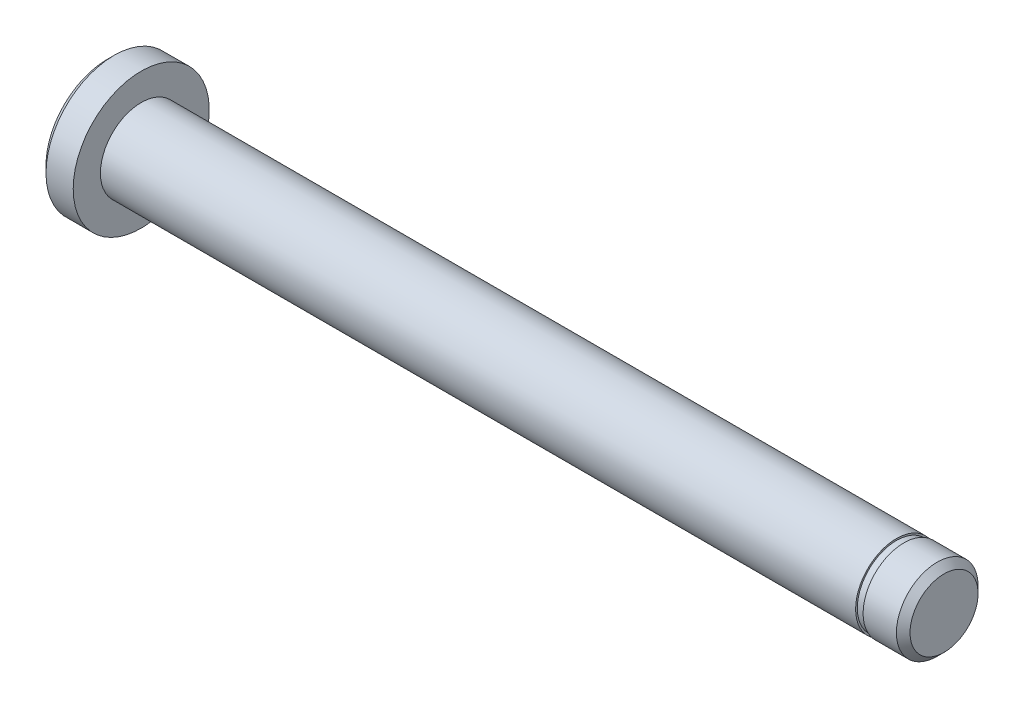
ISO-10303-21;
HEADER;
FILE_DESCRIPTION(('STEP AP214'),'2;1');
FILE_NAME('part.step','',(''),(''),'','','');
FILE_SCHEMA(('AUTOMOTIVE_DESIGN { 1 0 10303 214 1 1 1 1 }'));
ENDSEC;
DATA;
#1=APPLICATION_CONTEXT('core data for automotive mechanical design processes');
#2=APPLICATION_PROTOCOL_DEFINITION('international standard','automotive_design',2000,#1);
#3=PRODUCT_CONTEXT('',#1,'mechanical');
#4=PRODUCT('Part','Part','',(#3));
#5=PRODUCT_RELATED_PRODUCT_CATEGORY('part','',(#4));
#6=PRODUCT_DEFINITION_FORMATION('','',#4);
#7=PRODUCT_DEFINITION_CONTEXT('part definition',#1,'design');
#8=PRODUCT_DEFINITION('design','',#6,#7);
#9=PRODUCT_DEFINITION_SHAPE('','',#8);
#10=(LENGTH_UNIT() NAMED_UNIT(*) SI_UNIT(.MILLI.,.METRE.));
#11=(NAMED_UNIT(*) PLANE_ANGLE_UNIT() SI_UNIT($,.RADIAN.));
#12=(NAMED_UNIT(*) SI_UNIT($,.STERADIAN.) SOLID_ANGLE_UNIT());
#13=UNCERTAINTY_MEASURE_WITH_UNIT(LENGTH_MEASURE(1.E-05),#10,'distance_accuracy_value','');
#14=(GEOMETRIC_REPRESENTATION_CONTEXT(3) GLOBAL_UNCERTAINTY_ASSIGNED_CONTEXT((#13)) GLOBAL_UNIT_ASSIGNED_CONTEXT((#10,
#11,#12)) REPRESENTATION_CONTEXT('',''));
#15=CARTESIAN_POINT('',(0.,0.,0.));
#16=DIRECTION('',(0.,0.,1.));
#17=DIRECTION('',(1.,0.,0.));
#18=AXIS2_PLACEMENT_3D('',#15,#16,#17);
#19=CARTESIAN_POINT('',(-35.7171115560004,0.,0.));
#20=DIRECTION('',(1.,0.,0.));
#21=DIRECTION('',(0.,0.,-1.));
#22=AXIS2_PLACEMENT_3D('',#19,#20,#21);
#23=PLANE('',#22);
#24=CARTESIAN_POINT('',(-35.7171115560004,0.,0.));
#25=DIRECTION('',(1.,0.,0.));
#26=DIRECTION('',(0.,0.,-1.));
#27=AXIS2_PLACEMENT_3D('',#24,#25,#26);
#28=CIRCLE('',#27,9.00000000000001);
#29=CARTESIAN_POINT('',(-35.7171115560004,0.,-9.00000000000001));
#30=VERTEX_POINT('',#29);
#31=EDGE_CURVE('E35',#30,#30,#28,.F.);
#32=ORIENTED_EDGE('',*,*,#31,.T.);
#33=EDGE_LOOP('',(#32));
#34=FACE_BOUND('',#33,.T.);
#35=ADVANCED_FACE('F29',(#34),#23,.F.);
#36=CARTESIAN_POINT('',(-49.6368423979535,0.,0.));
#37=DIRECTION('',(-1.,0.,0.));
#38=DIRECTION('',(0.,0.,1.));
#39=AXIS2_PLACEMENT_3D('',#36,#37,#38);
#40=CYLINDRICAL_SURFACE('',#39,10.);
#41=CARTESIAN_POINT('',(-34.7171115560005,0.,0.));
#42=DIRECTION('',(1.,0.,0.));
#43=DIRECTION('',(0.,0.,-1.));
#44=AXIS2_PLACEMENT_3D('',#41,#42,#43);
#45=CIRCLE('',#44,10.);
#46=CARTESIAN_POINT('',(-34.7171115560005,0.,-10.));
#47=VERTEX_POINT('',#46);
#48=EDGE_CURVE('E10',#47,#47,#45,.T.);
#49=ORIENTED_EDGE('',*,*,#48,.T.);
#50=EDGE_LOOP('',(#49));
#51=FACE_BOUND('',#50,.T.);
#52=CARTESIAN_POINT('',(-30.7171115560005,0.,0.));
#53=DIRECTION('',(-1.,0.,0.));
#54=DIRECTION('',(0.,0.,1.));
#55=AXIS2_PLACEMENT_3D('',#52,#53,#54);
#56=CIRCLE('',#55,10.);
#57=CARTESIAN_POINT('',(-30.7171115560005,0.,10.));
#58=VERTEX_POINT('',#57);
#59=EDGE_CURVE('E48',#58,#58,#56,.T.);
#60=ORIENTED_EDGE('',*,*,#59,.T.);
#61=EDGE_LOOP('',(#60));
#62=FACE_BOUND('',#61,.T.);
#63=ADVANCED_FACE('F85',(#51,#62),#40,.T.);
#64=CARTESIAN_POINT('',(-30.7171115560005,10.,0.));
#65=DIRECTION('',(-1.,0.,0.));
#66=DIRECTION('',(0.,0.,1.));
#67=AXIS2_PLACEMENT_3D('',#64,#65,#66);
#68=PLANE('',#67);
#69=ORIENTED_EDGE('',*,*,#59,.F.);
#70=EDGE_LOOP('',(#69));
#71=FACE_BOUND('',#70,.T.);
#72=CARTESIAN_POINT('',(-30.7171115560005,0.,0.));
#73=DIRECTION('',(-1.,0.,0.));
#74=DIRECTION('',(0.,0.,1.));
#75=AXIS2_PLACEMENT_3D('',#72,#73,#74);
#76=CIRCLE('',#75,6.);
#77=CARTESIAN_POINT('',(-30.7171115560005,0.,6.));
#78=VERTEX_POINT('',#77);
#79=EDGE_CURVE('E51',#78,#78,#76,.T.);
#80=ORIENTED_EDGE('',*,*,#79,.T.);
#81=EDGE_LOOP('',(#80));
#82=FACE_BOUND('',#81,.T.);
#83=ADVANCED_FACE('F89',(#71,#82),#68,.F.);
#84=CARTESIAN_POINT('',(-49.6368423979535,0.,0.));
#85=DIRECTION('',(-1.,0.,0.));
#86=DIRECTION('',(0.,0.,1.));
#87=AXIS2_PLACEMENT_3D('',#84,#85,#86);
#88=CYLINDRICAL_SURFACE('',#87,6.);
#89=ORIENTED_EDGE('',*,*,#79,.F.);
#90=EDGE_LOOP('',(#89));
#91=FACE_BOUND('',#90,.T.);
#92=CARTESIAN_POINT('',(80.2828884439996,0.,0.));
#93=DIRECTION('',(-1.,0.,0.));
#94=DIRECTION('',(0.,0.,1.));
#95=AXIS2_PLACEMENT_3D('',#92,#93,#94);
#96=CIRCLE('',#95,6.);
#97=CARTESIAN_POINT('',(80.2828884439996,0.,6.));
#98=VERTEX_POINT('',#97);
#99=EDGE_CURVE('E54',#98,#98,#96,.T.);
#100=ORIENTED_EDGE('',*,*,#99,.T.);
#101=EDGE_LOOP('',(#100));
#102=FACE_BOUND('',#101,.T.);
#103=ADVANCED_FACE('F93',(#91,#102),#88,.T.);
#104=CARTESIAN_POINT('',(80.2828884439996,6.,0.));
#105=DIRECTION('',(-1.,0.,0.));
#106=DIRECTION('',(0.,0.,1.));
#107=AXIS2_PLACEMENT_3D('',#104,#105,#106);
#108=PLANE('',#107);
#109=ORIENTED_EDGE('',*,*,#99,.F.);
#110=EDGE_LOOP('',(#109));
#111=FACE_BOUND('',#110,.T.);
#112=CARTESIAN_POINT('',(80.2828884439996,0.,0.));
#113=DIRECTION('',(-1.,0.,0.));
#114=DIRECTION('',(0.,0.,1.));
#115=AXIS2_PLACEMENT_3D('',#112,#113,#114);
#116=CIRCLE('',#115,5.75);
#117=CARTESIAN_POINT('',(80.2828884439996,0.,5.75));
#118=VERTEX_POINT('',#117);
#119=EDGE_CURVE('E57',#118,#118,#116,.T.);
#120=ORIENTED_EDGE('',*,*,#119,.T.);
#121=EDGE_LOOP('',(#120));
#122=FACE_BOUND('',#121,.T.);
#123=ADVANCED_FACE('F100',(#111,#122),#108,.F.);
#124=CARTESIAN_POINT('',(-49.6368423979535,0.,0.));
#125=DIRECTION('',(-1.,0.,0.));
#126=DIRECTION('',(0.,0.,1.));
#127=AXIS2_PLACEMENT_3D('',#124,#125,#126);
#128=CYLINDRICAL_SURFACE('',#127,5.75);
#129=ORIENTED_EDGE('',*,*,#119,.F.);
#130=EDGE_LOOP('',(#129));
#131=FACE_BOUND('',#130,.T.);
#132=CARTESIAN_POINT('',(81.3828884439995,0.,0.));
#133=DIRECTION('',(-1.,0.,0.));
#134=DIRECTION('',(0.,0.,1.));
#135=AXIS2_PLACEMENT_3D('',#132,#133,#134);
#136=CIRCLE('',#135,5.75);
#137=CARTESIAN_POINT('',(81.3828884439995,0.,5.75));
#138=VERTEX_POINT('',#137);
#139=EDGE_CURVE('E60',#138,#138,#136,.T.);
#140=ORIENTED_EDGE('',*,*,#139,.T.);
#141=EDGE_LOOP('',(#140));
#142=FACE_BOUND('',#141,.T.);
#143=ADVANCED_FACE('F81',(#131,#142),#128,.T.);
#144=CARTESIAN_POINT('',(81.3828884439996,5.75,0.));
#145=DIRECTION('',(1.,0.,0.));
#146=DIRECTION('',(0.,0.,-1.));
#147=AXIS2_PLACEMENT_3D('',#144,#145,#146);
#148=PLANE('',#147);
#149=ORIENTED_EDGE('',*,*,#139,.F.);
#150=EDGE_LOOP('',(#149));
#151=FACE_BOUND('',#150,.T.);
#152=CARTESIAN_POINT('',(81.3828884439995,0.,0.));
#153=DIRECTION('',(-1.,0.,0.));
#154=DIRECTION('',(0.,0.,1.));
#155=AXIS2_PLACEMENT_3D('',#152,#153,#154);
#156=CIRCLE('',#155,6.);
#157=CARTESIAN_POINT('',(81.3828884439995,0.,6.));
#158=VERTEX_POINT('',#157);
#159=EDGE_CURVE('E63',#158,#158,#156,.T.);
#160=ORIENTED_EDGE('',*,*,#159,.T.);
#161=EDGE_LOOP('',(#160));
#162=FACE_BOUND('',#161,.T.);
#163=ADVANCED_FACE('F67',(#151,#162),#148,.F.);
#164=CARTESIAN_POINT('',(-49.6368423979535,0.,0.));
#165=DIRECTION('',(-1.,0.,0.));
#166=DIRECTION('',(0.,0.,1.));
#167=AXIS2_PLACEMENT_3D('',#164,#165,#166);
#168=CYLINDRICAL_SURFACE('',#167,6.);
#169=CARTESIAN_POINT('',(86.2828884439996,0.,0.));
#170=DIRECTION('',(-1.,0.,0.));
#171=DIRECTION('',(0.,0.,1.));
#172=AXIS2_PLACEMENT_3D('',#169,#170,#171);
#173=CIRCLE('',#172,6.);
#174=CARTESIAN_POINT('',(86.2828884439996,0.,6.));
#175=VERTEX_POINT('',#174);
#176=EDGE_CURVE('E43',#175,#175,#173,.T.);
#177=ORIENTED_EDGE('',*,*,#176,.T.);
#178=EDGE_LOOP('',(#177));
#179=FACE_BOUND('',#178,.T.);
#180=ORIENTED_EDGE('',*,*,#159,.F.);
#181=EDGE_LOOP('',(#180));
#182=FACE_BOUND('',#181,.T.);
#183=ADVANCED_FACE('F69',(#179,#182),#168,.T.);
#184=CARTESIAN_POINT('',(87.2828884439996,6.,0.));
#185=DIRECTION('',(-1.,0.,0.));
#186=DIRECTION('',(0.,0.,1.));
#187=AXIS2_PLACEMENT_3D('',#184,#185,#186);
#188=PLANE('',#187);
#189=CARTESIAN_POINT('',(87.2828884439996,0.,0.));
#190=DIRECTION('',(-1.,0.,0.));
#191=DIRECTION('',(0.,0.,1.));
#192=AXIS2_PLACEMENT_3D('',#189,#190,#191);
#193=CIRCLE('',#192,5.00000000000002);
#194=CARTESIAN_POINT('',(87.2828884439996,0.,5.00000000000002));
#195=VERTEX_POINT('',#194);
#196=EDGE_CURVE('E39',#195,#195,#193,.F.);
#197=ORIENTED_EDGE('',*,*,#196,.T.);
#198=EDGE_LOOP('',(#197));
#199=FACE_BOUND('',#198,.T.);
#200=ADVANCED_FACE('F71',(#199),#188,.F.);
#201=CARTESIAN_POINT('',(86.2828884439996,0.,0.));
#202=DIRECTION('',(-1.,0.,0.));
#203=DIRECTION('',(0.,0.,1.));
#204=AXIS2_PLACEMENT_3D('',#201,#202,#203);
#205=CONICAL_SURFACE('',#204,6.,0.785398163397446);
#206=ORIENTED_EDGE('',*,*,#196,.F.);
#207=EDGE_LOOP('',(#206));
#208=FACE_BOUND('',#207,.T.);
#209=ORIENTED_EDGE('',*,*,#176,.F.);
#210=EDGE_LOOP('',(#209));
#211=FACE_BOUND('',#210,.T.);
#212=ADVANCED_FACE('F78',(#208,#211),#205,.T.);
#213=CARTESIAN_POINT('',(-35.7171115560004,0.,0.));
#214=DIRECTION('',(1.,0.,0.));
#215=DIRECTION('',(0.,0.,-1.));
#216=AXIS2_PLACEMENT_3D('',#213,#214,#215);
#217=CONICAL_SURFACE('',#216,9.00000000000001,0.785398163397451);
#218=ORIENTED_EDGE('',*,*,#48,.F.);
#219=EDGE_LOOP('',(#218));
#220=FACE_BOUND('',#219,.T.);
#221=ORIENTED_EDGE('',*,*,#31,.F.);
#222=EDGE_LOOP('',(#221));
#223=FACE_BOUND('',#222,.T.);
#224=ADVANCED_FACE('F137',(#220,#223),#217,.T.);
#225=CLOSED_SHELL('',(#35,#63,#83,#103,#123,#143,#163,#183,#200,#212,#224));
#226=MANIFOLD_SOLID_BREP('B2',#225);
#227=ADVANCED_BREP_SHAPE_REPRESENTATION('',(#18,#226),#14);
#228=SHAPE_DEFINITION_REPRESENTATION(#9,#227);
ENDSEC;
END-ISO-10303-21;
